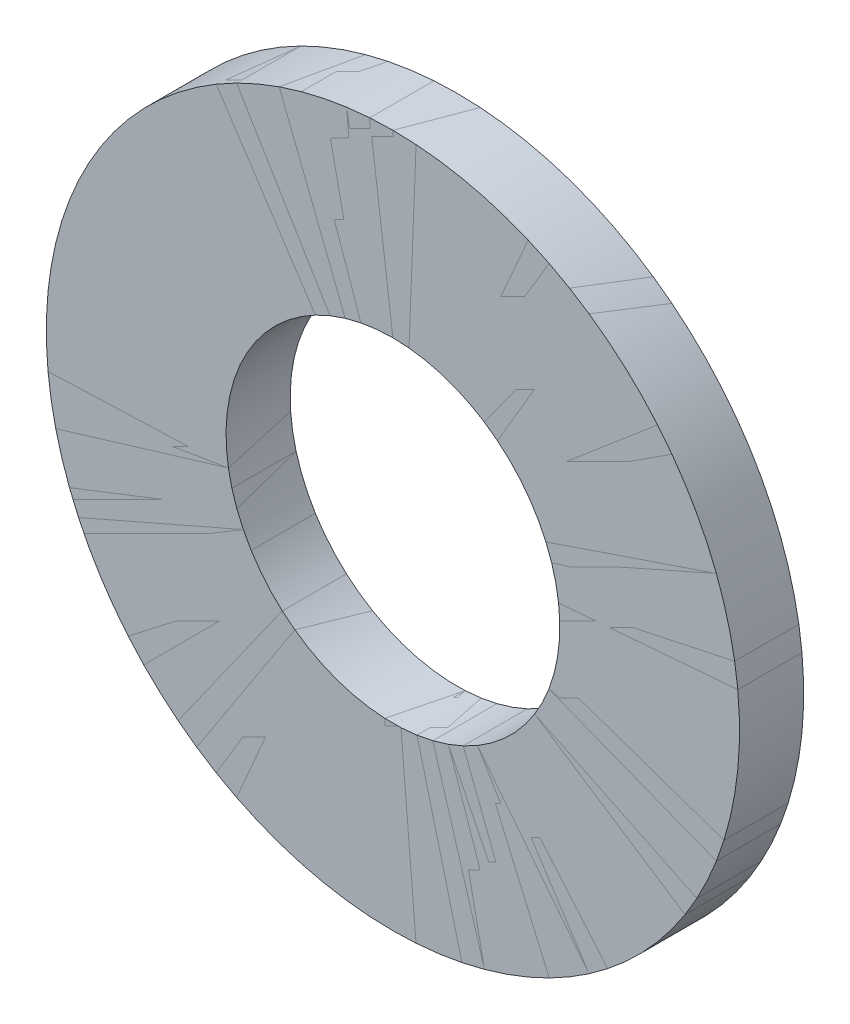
ISO-10303-21;
HEADER;
FILE_DESCRIPTION(('STEP AP214'),'2;1');
FILE_NAME('part.step','',(''),(''),'','','');
FILE_SCHEMA(('AUTOMOTIVE_DESIGN { 1 0 10303 214 1 1 1 1 }'));
ENDSEC;
DATA;
#1=APPLICATION_CONTEXT('core data for automotive mechanical design processes');
#2=APPLICATION_PROTOCOL_DEFINITION('international standard','automotive_design',2000,#1);
#3=PRODUCT_CONTEXT('',#1,'mechanical');
#4=PRODUCT('Part','Part','',(#3));
#5=PRODUCT_RELATED_PRODUCT_CATEGORY('part','',(#4));
#6=PRODUCT_DEFINITION_FORMATION('','',#4);
#7=PRODUCT_DEFINITION_CONTEXT('part definition',#1,'design');
#8=PRODUCT_DEFINITION('design','',#6,#7);
#9=PRODUCT_DEFINITION_SHAPE('','',#8);
#10=(LENGTH_UNIT() NAMED_UNIT(*) SI_UNIT(.MILLI.,.METRE.));
#11=(NAMED_UNIT(*) PLANE_ANGLE_UNIT() SI_UNIT($,.RADIAN.));
#12=(NAMED_UNIT(*) SI_UNIT($,.STERADIAN.) SOLID_ANGLE_UNIT());
#13=UNCERTAINTY_MEASURE_WITH_UNIT(LENGTH_MEASURE(1.E-05),#10,'distance_accuracy_value','');
#14=(GEOMETRIC_REPRESENTATION_CONTEXT(3) GLOBAL_UNCERTAINTY_ASSIGNED_CONTEXT((#13)) GLOBAL_UNIT_ASSIGNED_CONTEXT((#10,
#11,#12)) REPRESENTATION_CONTEXT('',''));
#15=CARTESIAN_POINT('',(0.,0.,0.));
#16=DIRECTION('',(0.,0.,1.));
#17=DIRECTION('',(1.,0.,0.));
#18=AXIS2_PLACEMENT_3D('',#15,#16,#17);
#19=CARTESIAN_POINT('',(0.,0.,0.));
#20=DIRECTION('',(0.,0.,-1.));
#21=DIRECTION('',(0.,1.,0.));
#22=AXIS2_PLACEMENT_3D('',#19,#20,#21);
#23=CYLINDRICAL_SURFACE('',#22,6.5);
#24=CARTESIAN_POINT('',(0.,0.,2.5));
#25=DIRECTION('',(0.,0.,-1.));
#26=DIRECTION('',(0.,1.,0.));
#27=AXIS2_PLACEMENT_3D('',#24,#25,#26);
#28=CIRCLE('',#27,6.5);
#29=CARTESIAN_POINT('',(0.,6.5,2.5));
#30=VERTEX_POINT('',#29);
#31=EDGE_CURVE('P0_E10',#30,#30,#28,.T.);
#32=ORIENTED_EDGE('',*,*,#31,.F.);
#33=EDGE_LOOP('',(#32));
#34=FACE_BOUND('',#33,.T.);
#35=CARTESIAN_POINT('',(0.,0.,0.));
#36=DIRECTION('',(0.,0.,-1.));
#37=DIRECTION('',(0.,1.,0.));
#38=AXIS2_PLACEMENT_3D('',#35,#36,#37);
#39=CIRCLE('',#38,6.5);
#40=CARTESIAN_POINT('',(0.,6.5,0.));
#41=VERTEX_POINT('',#40);
#42=EDGE_CURVE('P0_E38',#41,#41,#39,.T.);
#43=ORIENTED_EDGE('',*,*,#42,.T.);
#44=EDGE_LOOP('',(#43));
#45=FACE_BOUND('',#44,.T.);
#46=ADVANCED_FACE('P0_F24',(#34,#45),#23,.F.);
#47=CARTESIAN_POINT('',(13.5,0.,2.5));
#48=DIRECTION('',(0.,0.,1.));
#49=DIRECTION('',(0.,-1.,0.));
#50=AXIS2_PLACEMENT_3D('',#47,#48,#49);
#51=PLANE('',#50);
#52=ORIENTED_EDGE('',*,*,#31,.T.);
#53=EDGE_LOOP('',(#52));
#54=FACE_BOUND('',#53,.T.);
#55=CARTESIAN_POINT('',(0.,0.,2.5));
#56=DIRECTION('',(0.,0.,-1.));
#57=DIRECTION('',(0.,1.,0.));
#58=AXIS2_PLACEMENT_3D('',#55,#56,#57);
#59=CIRCLE('',#58,13.5);
#60=CARTESIAN_POINT('',(0.,13.5,2.5));
#61=VERTEX_POINT('',#60);
#62=EDGE_CURVE('P0_E30',#61,#61,#59,.T.);
#63=ORIENTED_EDGE('',*,*,#62,.F.);
#64=EDGE_LOOP('',(#63));
#65=FACE_BOUND('',#64,.T.);
#66=ADVANCED_FACE('P0_F53',(#54,#65),#51,.T.);
#67=CARTESIAN_POINT('',(0.,0.,0.));
#68=DIRECTION('',(0.,0.,-1.));
#69=DIRECTION('',(0.,1.,0.));
#70=AXIS2_PLACEMENT_3D('',#67,#68,#69);
#71=CYLINDRICAL_SURFACE('',#70,13.5);
#72=ORIENTED_EDGE('',*,*,#62,.T.);
#73=EDGE_LOOP('',(#72));
#74=FACE_BOUND('',#73,.T.);
#75=CARTESIAN_POINT('',(0.,0.,0.));
#76=DIRECTION('',(0.,0.,-1.));
#77=DIRECTION('',(0.,1.,0.));
#78=AXIS2_PLACEMENT_3D('',#75,#76,#77);
#79=CIRCLE('',#78,13.5);
#80=CARTESIAN_POINT('',(0.,13.5,0.));
#81=VERTEX_POINT('',#80);
#82=EDGE_CURVE('P0_E34',#81,#81,#79,.T.);
#83=ORIENTED_EDGE('',*,*,#82,.F.);
#84=EDGE_LOOP('',(#83));
#85=FACE_BOUND('',#84,.T.);
#86=ADVANCED_FACE('P0_F47',(#74,#85),#71,.T.);
#87=CARTESIAN_POINT('',(6.5,0.,0.));
#88=DIRECTION('',(0.,0.,-1.));
#89=DIRECTION('',(0.,1.,0.));
#90=AXIS2_PLACEMENT_3D('',#87,#88,#89);
#91=PLANE('',#90);
#92=ORIENTED_EDGE('',*,*,#82,.T.);
#93=EDGE_LOOP('',(#92));
#94=FACE_BOUND('',#93,.T.);
#95=ORIENTED_EDGE('',*,*,#42,.F.);
#96=EDGE_LOOP('',(#95));
#97=FACE_BOUND('',#96,.T.);
#98=ADVANCED_FACE('P0_F45',(#94,#97),#91,.T.);
#99=CLOSED_SHELL('',(#46,#66,#86,#98));
#100=MANIFOLD_SOLID_BREP('P0_B2',#99);
#101=CARTESIAN_POINT('',(0.,0.,0.));
#102=DIRECTION('',(0.,0.,-1.));
#103=DIRECTION('',(0.,1.,0.));
#104=AXIS2_PLACEMENT_3D('',#101,#102,#103);
#105=CYLINDRICAL_SURFACE('',#104,6.5);
#106=CARTESIAN_POINT('',(0.,0.,2.5));
#107=DIRECTION('',(0.,0.,-1.));
#108=DIRECTION('',(0.,1.,0.));
#109=AXIS2_PLACEMENT_3D('',#106,#107,#108);
#110=CIRCLE('',#109,6.5);
#111=CARTESIAN_POINT('',(0.,6.5,2.5));
#112=VERTEX_POINT('',#111);
#113=EDGE_CURVE('P1_E10',#112,#112,#110,.T.);
#114=ORIENTED_EDGE('',*,*,#113,.F.);
#115=EDGE_LOOP('',(#114));
#116=FACE_BOUND('',#115,.T.);
#117=CARTESIAN_POINT('',(0.,0.,0.));
#118=DIRECTION('',(0.,0.,-1.));
#119=DIRECTION('',(0.,1.,0.));
#120=AXIS2_PLACEMENT_3D('',#117,#118,#119);
#121=CIRCLE('',#120,6.5);
#122=CARTESIAN_POINT('',(0.,6.5,0.));
#123=VERTEX_POINT('',#122);
#124=EDGE_CURVE('P1_E28',#123,#123,#121,.T.);
#125=ORIENTED_EDGE('',*,*,#124,.T.);
#126=EDGE_LOOP('',(#125));
#127=FACE_BOUND('',#126,.T.);
#128=ADVANCED_FACE('P1_F14',(#116,#127),#105,.F.);
#129=CARTESIAN_POINT('',(13.5,0.,2.5));
#130=DIRECTION('',(0.,0.,1.));
#131=DIRECTION('',(0.,-1.,0.));
#132=AXIS2_PLACEMENT_3D('',#129,#130,#131);
#133=PLANE('',#132);
#134=ORIENTED_EDGE('',*,*,#113,.T.);
#135=EDGE_LOOP('',(#134));
#136=FACE_BOUND('',#135,.T.);
#137=CARTESIAN_POINT('',(0.,0.,2.5));
#138=DIRECTION('',(0.,0.,-1.));
#139=DIRECTION('',(0.,1.,0.));
#140=AXIS2_PLACEMENT_3D('',#137,#138,#139);
#141=CIRCLE('',#140,13.5);
#142=CARTESIAN_POINT('',(0.,13.5,2.5));
#143=VERTEX_POINT('',#142);
#144=EDGE_CURVE('P1_E20',#143,#143,#141,.T.);
#145=ORIENTED_EDGE('',*,*,#144,.F.);
#146=EDGE_LOOP('',(#145));
#147=FACE_BOUND('',#146,.T.);
#148=ADVANCED_FACE('P1_F44',(#136,#147),#133,.T.);
#149=CARTESIAN_POINT('',(0.,0.,0.));
#150=DIRECTION('',(0.,0.,-1.));
#151=DIRECTION('',(0.,1.,0.));
#152=AXIS2_PLACEMENT_3D('',#149,#150,#151);
#153=CYLINDRICAL_SURFACE('',#152,13.5);
#154=ORIENTED_EDGE('',*,*,#144,.T.);
#155=EDGE_LOOP('',(#154));
#156=FACE_BOUND('',#155,.T.);
#157=CARTESIAN_POINT('',(0.,0.,0.));
#158=DIRECTION('',(0.,0.,-1.));
#159=DIRECTION('',(0.,1.,0.));
#160=AXIS2_PLACEMENT_3D('',#157,#158,#159);
#161=CIRCLE('',#160,13.5);
#162=CARTESIAN_POINT('',(0.,13.5,0.));
#163=VERTEX_POINT('',#162);
#164=EDGE_CURVE('P1_E24',#163,#163,#161,.T.);
#165=ORIENTED_EDGE('',*,*,#164,.F.);
#166=EDGE_LOOP('',(#165));
#167=FACE_BOUND('',#166,.T.);
#168=ADVANCED_FACE('P1_F37',(#156,#167),#153,.T.);
#169=CARTESIAN_POINT('',(6.5,0.,0.));
#170=DIRECTION('',(0.,0.,-1.));
#171=DIRECTION('',(0.,1.,0.));
#172=AXIS2_PLACEMENT_3D('',#169,#170,#171);
#173=PLANE('',#172);
#174=ORIENTED_EDGE('',*,*,#164,.T.);
#175=EDGE_LOOP('',(#174));
#176=FACE_BOUND('',#175,.T.);
#177=ORIENTED_EDGE('',*,*,#124,.F.);
#178=EDGE_LOOP('',(#177));
#179=FACE_BOUND('',#178,.T.);
#180=ADVANCED_FACE('P1_F35',(#176,#179),#173,.T.);
#181=CLOSED_SHELL('',(#128,#148,#168,#180));
#182=MANIFOLD_SOLID_BREP('P1_B1',#181);
#183=ADVANCED_BREP_SHAPE_REPRESENTATION('',(#18,#100,#182),#14);
#184=SHAPE_DEFINITION_REPRESENTATION(#9,#183);
ENDSEC;
END-ISO-10303-21;
